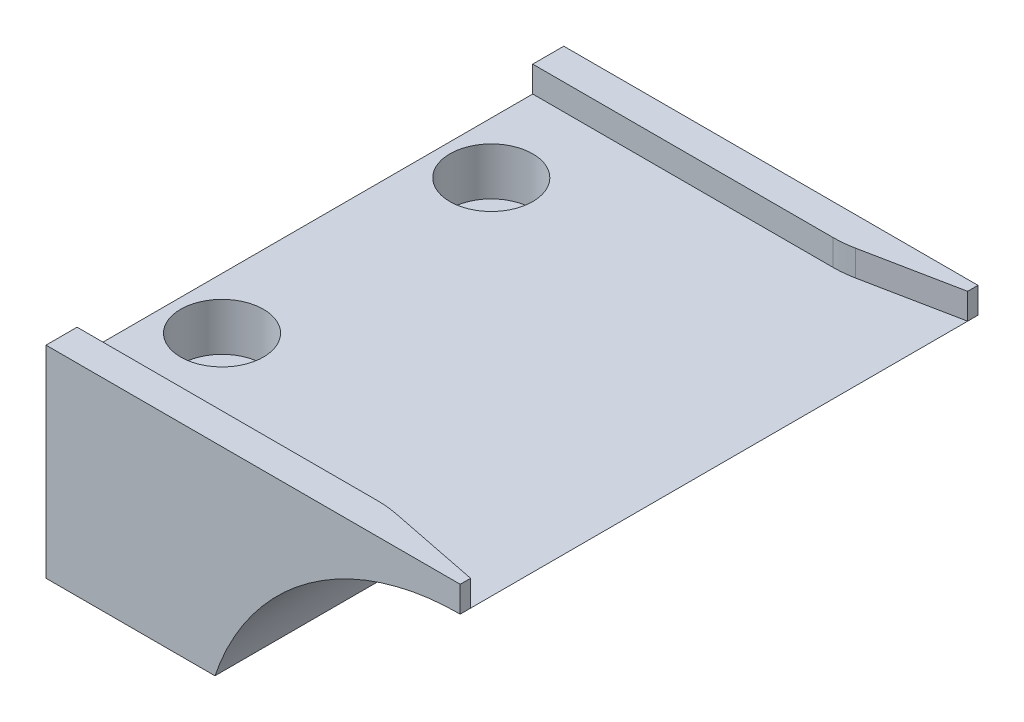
ISO-10303-21;
HEADER;
FILE_DESCRIPTION(('STEP AP214'),'2;1');
FILE_NAME('part.step','',(''),(''),'','','');
FILE_SCHEMA(('AUTOMOTIVE_DESIGN { 1 0 10303 214 1 1 1 1 }'));
ENDSEC;
DATA;
#1=APPLICATION_CONTEXT('core data for automotive mechanical design processes');
#2=APPLICATION_PROTOCOL_DEFINITION('international standard','automotive_design',2000,#1);
#3=PRODUCT_CONTEXT('',#1,'mechanical');
#4=PRODUCT('Part','Part','',(#3));
#5=PRODUCT_RELATED_PRODUCT_CATEGORY('part','',(#4));
#6=PRODUCT_DEFINITION_FORMATION('','',#4);
#7=PRODUCT_DEFINITION_CONTEXT('part definition',#1,'design');
#8=PRODUCT_DEFINITION('design','',#6,#7);
#9=PRODUCT_DEFINITION_SHAPE('','',#8);
#10=(LENGTH_UNIT() NAMED_UNIT(*) SI_UNIT(.MILLI.,.METRE.));
#11=(NAMED_UNIT(*) PLANE_ANGLE_UNIT() SI_UNIT($,.RADIAN.));
#12=(NAMED_UNIT(*) SI_UNIT($,.STERADIAN.) SOLID_ANGLE_UNIT());
#13=UNCERTAINTY_MEASURE_WITH_UNIT(LENGTH_MEASURE(1.E-05),#10,'distance_accuracy_value','');
#14=(GEOMETRIC_REPRESENTATION_CONTEXT(3) GLOBAL_UNCERTAINTY_ASSIGNED_CONTEXT((#13)) GLOBAL_UNIT_ASSIGNED_CONTEXT((#10,
#11,#12)) REPRESENTATION_CONTEXT('',''));
#15=CARTESIAN_POINT('',(0.,0.,0.));
#16=DIRECTION('',(0.,0.,1.));
#17=DIRECTION('',(1.,0.,0.));
#18=AXIS2_PLACEMENT_3D('',#15,#16,#17);
#19=CARTESIAN_POINT('',(-40.919983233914,13.236941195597,50.));
#20=DIRECTION('',(0.,-1.,0.));
#21=DIRECTION('',(1.,0.,0.));
#22=AXIS2_PLACEMENT_3D('',#19,#20,#21);
#23=PLANE('',#22);
#24=CARTESIAN_POINT('',(-75.919983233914,13.236941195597,12.));
#25=DIRECTION('',(0.,1.,0.));
#26=DIRECTION('',(0.,0.,1.));
#27=AXIS2_PLACEMENT_3D('',#24,#25,#26);
#28=CIRCLE('',#27,4.);
#29=CARTESIAN_POINT('',(-75.919983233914,13.236941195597,16.));
#30=VERTEX_POINT('',#29);
#31=EDGE_CURVE('E428',#30,#30,#28,.T.);
#32=ORIENTED_EDGE('',*,*,#31,.F.);
#33=EDGE_LOOP('',(#32));
#34=FACE_BOUND('',#33,.T.);
#35=DIRECTION('',(0.,0.,-1.));
#36=VECTOR('',#35,1.);
#37=CARTESIAN_POINT('',(-80.919983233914,13.236941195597,50.));
#38=LINE('',#37,#36);
#39=CARTESIAN_POINT('',(-80.919983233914,13.236941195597,47.));
#40=VERTEX_POINT('',#39);
#41=CARTESIAN_POINT('',(-80.919983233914,13.236941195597,3.));
#42=VERTEX_POINT('',#41);
#43=EDGE_CURVE('E177',#40,#42,#38,.T.);
#44=ORIENTED_EDGE('',*,*,#43,.F.);
#45=DIRECTION('',(-1.,0.,0.));
#46=VECTOR('',#45,1.);
#47=CARTESIAN_POINT('',(-40.919983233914,13.236941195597,47.));
#48=LINE('',#47,#46);
#49=CARTESIAN_POINT('',(-51.910178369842,13.236941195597,47.));
#50=VERTEX_POINT('',#49);
#51=EDGE_CURVE('E146',#50,#40,#48,.T.);
#52=ORIENTED_EDGE('',*,*,#51,.F.);
#53=CARTESIAN_POINT('',(-51.910178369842,13.236941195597,57.));
#54=DIRECTION('',(0.,-1.,0.));
#55=DIRECTION('',(1.,0.,0.));
#56=AXIS2_PLACEMENT_3D('',#53,#54,#55);
#57=CIRCLE('',#56,10.);
#58=CARTESIAN_POINT('',(-49.9490170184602,13.236941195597,47.1941932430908));
#59=VERTEX_POINT('',#58);
#60=EDGE_CURVE('E24',#50,#59,#57,.T.);
#61=ORIENTED_EDGE('',*,*,#60,.T.);
#62=DIRECTION('',(0.980580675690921,0.,0.196116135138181));
#63=VECTOR('',#62,1.);
#64=CARTESIAN_POINT('',(-40.7276755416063,13.236941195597,49.0384615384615));
#65=LINE('',#64,#63);
#66=CARTESIAN_POINT('',(-40.919983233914,13.236941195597,49.));
#67=VERTEX_POINT('',#66);
#68=EDGE_CURVE('E204',#59,#67,#65,.T.);
#69=ORIENTED_EDGE('',*,*,#68,.T.);
#70=DIRECTION('',(0.,0.,-1.));
#71=VECTOR('',#70,1.);
#72=CARTESIAN_POINT('',(-40.919983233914,13.236941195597,50.));
#73=LINE('',#72,#71);
#74=CARTESIAN_POINT('',(-40.919983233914,13.236941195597,1.));
#75=VERTEX_POINT('',#74);
#76=EDGE_CURVE('E185',#67,#75,#73,.T.);
#77=ORIENTED_EDGE('',*,*,#76,.T.);
#78=DIRECTION('',(0.980580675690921,0.,-0.19611613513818));
#79=VECTOR('',#78,1.);
#80=CARTESIAN_POINT('',(-50.3430601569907,13.236941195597,2.88461538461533));
#81=LINE('',#80,#79);
#82=CARTESIAN_POINT('',(-49.9490170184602,13.236941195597,2.80580675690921));
#83=VERTEX_POINT('',#82);
#84=EDGE_CURVE('E202',#75,#83,#81,.F.);
#85=ORIENTED_EDGE('',*,*,#84,.T.);
#86=CARTESIAN_POINT('',(-51.910178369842,13.236941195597,-7.));
#87=DIRECTION('',(0.,-1.,0.));
#88=DIRECTION('',(1.,0.,0.));
#89=AXIS2_PLACEMENT_3D('',#86,#87,#88);
#90=CIRCLE('',#89,10.);
#91=CARTESIAN_POINT('',(-51.910178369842,13.236941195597,3.));
#92=VERTEX_POINT('',#91);
#93=EDGE_CURVE('E11',#83,#92,#90,.T.);
#94=ORIENTED_EDGE('',*,*,#93,.T.);
#95=DIRECTION('',(-1.,0.,0.));
#96=VECTOR('',#95,1.);
#97=CARTESIAN_POINT('',(-40.919983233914,13.236941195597,3.));
#98=LINE('',#97,#96);
#99=EDGE_CURVE('E159',#92,#42,#98,.T.);
#100=ORIENTED_EDGE('',*,*,#99,.T.);
#101=EDGE_LOOP('',(#44,#52,#61,#69,#77,#85,#94,#100));
#102=FACE_BOUND('',#101,.T.);
#103=CARTESIAN_POINT('',(-75.919983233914,13.236941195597,38.));
#104=DIRECTION('',(0.,1.,0.));
#105=DIRECTION('',(0.,0.,1.));
#106=AXIS2_PLACEMENT_3D('',#103,#104,#105);
#107=CIRCLE('',#106,4.);
#108=CARTESIAN_POINT('',(-75.919983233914,13.236941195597,42.));
#109=VERTEX_POINT('',#108);
#110=EDGE_CURVE('E438',#109,#109,#107,.T.);
#111=ORIENTED_EDGE('',*,*,#110,.F.);
#112=EDGE_LOOP('',(#111));
#113=FACE_BOUND('',#112,.T.);
#114=ADVANCED_FACE('F16',(#34,#102,#113),#23,.F.);
#115=CARTESIAN_POINT('',(-80.919983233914,-3.763058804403,50.));
#116=DIRECTION('',(1.,0.,0.));
#117=DIRECTION('',(0.,0.,-1.));
#118=AXIS2_PLACEMENT_3D('',#115,#116,#117);
#119=PLANE('',#118);
#120=DIRECTION('',(0.,-1.,0.));
#121=VECTOR('',#120,1.);
#122=CARTESIAN_POINT('',(-80.919983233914,-3.763058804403,0.));
#123=LINE('',#122,#121);
#124=CARTESIAN_POINT('',(-80.919983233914,15.736941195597,0.));
#125=VERTEX_POINT('',#124);
#126=CARTESIAN_POINT('',(-80.919983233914,-3.763058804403,0.));
#127=VERTEX_POINT('',#126);
#128=EDGE_CURVE('E167',#125,#127,#123,.T.);
#129=ORIENTED_EDGE('',*,*,#128,.T.);
#130=DIRECTION('',(0.,0.,-1.));
#131=VECTOR('',#130,1.);
#132=CARTESIAN_POINT('',(-80.919983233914,-3.763058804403,50.));
#133=LINE('',#132,#131);
#134=CARTESIAN_POINT('',(-80.919983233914,-3.763058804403,50.));
#135=VERTEX_POINT('',#134);
#136=EDGE_CURVE('E191',#135,#127,#133,.T.);
#137=ORIENTED_EDGE('',*,*,#136,.F.);
#138=DIRECTION('',(0.,-1.,0.));
#139=VECTOR('',#138,1.);
#140=CARTESIAN_POINT('',(-80.919983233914,-3.763058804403,50.));
#141=LINE('',#140,#139);
#142=CARTESIAN_POINT('',(-80.919983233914,15.736941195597,50.));
#143=VERTEX_POINT('',#142);
#144=EDGE_CURVE('E171',#143,#135,#141,.T.);
#145=ORIENTED_EDGE('',*,*,#144,.F.);
#146=DIRECTION('',(0.,0.,-1.));
#147=VECTOR('',#146,1.);
#148=CARTESIAN_POINT('',(-80.919983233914,15.736941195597,50.));
#149=LINE('',#148,#147);
#150=CARTESIAN_POINT('',(-80.919983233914,15.736941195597,47.));
#151=VERTEX_POINT('',#150);
#152=EDGE_CURVE('E119',#143,#151,#149,.T.);
#153=ORIENTED_EDGE('',*,*,#152,.T.);
#154=DIRECTION('',(0.,-1.,0.));
#155=VECTOR('',#154,1.);
#156=CARTESIAN_POINT('',(-80.919983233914,13.236941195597,47.));
#157=LINE('',#156,#155);
#158=EDGE_CURVE('E137',#151,#40,#157,.T.);
#159=ORIENTED_EDGE('',*,*,#158,.T.);
#160=ORIENTED_EDGE('',*,*,#43,.T.);
#161=DIRECTION('',(0.,1.,0.));
#162=VECTOR('',#161,1.);
#163=CARTESIAN_POINT('',(-80.919983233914,13.236941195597,3.));
#164=LINE('',#163,#162);
#165=CARTESIAN_POINT('',(-80.919983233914,15.736941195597,3.));
#166=VERTEX_POINT('',#165);
#167=EDGE_CURVE('E148',#42,#166,#164,.T.);
#168=ORIENTED_EDGE('',*,*,#167,.T.);
#169=DIRECTION('',(0.,0.,-1.));
#170=VECTOR('',#169,1.);
#171=CARTESIAN_POINT('',(-80.919983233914,15.736941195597,0.));
#172=LINE('',#171,#170);
#173=EDGE_CURVE('E154',#166,#125,#172,.T.);
#174=ORIENTED_EDGE('',*,*,#173,.T.);
#175=EDGE_LOOP('',(#129,#137,#145,#153,#159,#160,#168,#174));
#176=FACE_BOUND('',#175,.T.);
#177=ADVANCED_FACE('F235',(#176),#119,.F.);
#178=CARTESIAN_POINT('',(-64.605421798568,-3.763058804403,50.));
#179=DIRECTION('',(0.,1.,0.));
#180=DIRECTION('',(-1.,0.,0.));
#181=AXIS2_PLACEMENT_3D('',#178,#179,#180);
#182=PLANE('',#181);
#183=CARTESIAN_POINT('',(-75.919983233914,-3.763058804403,12.));
#184=DIRECTION('',(0.,1.,0.));
#185=DIRECTION('',(0.,0.,1.));
#186=AXIS2_PLACEMENT_3D('',#183,#184,#185);
#187=CIRCLE('',#186,2.25);
#188=CARTESIAN_POINT('',(-75.919983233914,-3.763058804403,14.25));
#189=VERTEX_POINT('',#188);
#190=EDGE_CURVE('E435',#189,#189,#187,.T.);
#191=ORIENTED_EDGE('',*,*,#190,.T.);
#192=EDGE_LOOP('',(#191));
#193=FACE_BOUND('',#192,.T.);
#194=CARTESIAN_POINT('',(-75.919983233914,-3.763058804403,38.));
#195=DIRECTION('',(0.,1.,0.));
#196=DIRECTION('',(0.,0.,1.));
#197=AXIS2_PLACEMENT_3D('',#194,#195,#196);
#198=CIRCLE('',#197,2.25);
#199=CARTESIAN_POINT('',(-75.919983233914,-3.763058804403,40.25));
#200=VERTEX_POINT('',#199);
#201=EDGE_CURVE('E142',#200,#200,#198,.T.);
#202=ORIENTED_EDGE('',*,*,#201,.T.);
#203=EDGE_LOOP('',(#202));
#204=FACE_BOUND('',#203,.T.);
#205=DIRECTION('',(1.,0.,0.));
#206=VECTOR('',#205,1.);
#207=CARTESIAN_POINT('',(-64.605421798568,-3.763058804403,0.));
#208=LINE('',#207,#206);
#209=CARTESIAN_POINT('',(-64.605421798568,-3.763058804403,0.));
#210=VERTEX_POINT('',#209);
#211=EDGE_CURVE('E180',#127,#210,#208,.T.);
#212=ORIENTED_EDGE('',*,*,#211,.T.);
#213=DIRECTION('',(0.,0.,-1.));
#214=VECTOR('',#213,1.);
#215=CARTESIAN_POINT('',(-64.605421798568,-3.763058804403,50.));
#216=LINE('',#215,#214);
#217=CARTESIAN_POINT('',(-64.605421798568,-3.763058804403,50.));
#218=VERTEX_POINT('',#217);
#219=EDGE_CURVE('E188',#218,#210,#216,.T.);
#220=ORIENTED_EDGE('',*,*,#219,.F.);
#221=DIRECTION('',(1.,0.,0.));
#222=VECTOR('',#221,1.);
#223=CARTESIAN_POINT('',(-64.605421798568,-3.763058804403,50.));
#224=LINE('',#223,#222);
#225=EDGE_CURVE('E173',#135,#218,#224,.T.);
#226=ORIENTED_EDGE('',*,*,#225,.F.);
#227=ORIENTED_EDGE('',*,*,#136,.T.);
#228=EDGE_LOOP('',(#212,#220,#226,#227));
#229=FACE_BOUND('',#228,.T.);
#230=ADVANCED_FACE('F239',(#193,#204,#229),#182,.F.);
#231=CARTESIAN_POINT('',(-40.919983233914,-11.763058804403,50.));
#232=DIRECTION('',(0.,0.,-1.));
#233=DIRECTION('',(-1.,0.,0.));
#234=AXIS2_PLACEMENT_3D('',#231,#232,#233);
#235=CYLINDRICAL_SURFACE('',#234,25.);
#236=CARTESIAN_POINT('',(-40.919983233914,-11.763058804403,0.));
#237=DIRECTION('',(0.,0.,-1.));
#238=DIRECTION('',(1.,0.,0.));
#239=AXIS2_PLACEMENT_3D('',#236,#237,#238);
#240=CIRCLE('',#239,25.);
#241=CARTESIAN_POINT('',(-40.919983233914,13.236941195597,0.));
#242=VERTEX_POINT('',#241);
#243=EDGE_CURVE('E174',#210,#242,#240,.T.);
#244=ORIENTED_EDGE('',*,*,#243,.T.);
#245=DIRECTION('',(0.,0.,1.));
#246=VECTOR('',#245,1.);
#247=CARTESIAN_POINT('',(-40.919983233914,13.236941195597,0.));
#248=LINE('',#247,#246);
#249=EDGE_CURVE('E153',#242,#75,#248,.T.);
#250=ORIENTED_EDGE('',*,*,#249,.T.);
#251=ORIENTED_EDGE('',*,*,#76,.F.);
#252=CARTESIAN_POINT('',(-40.919983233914,13.236941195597,50.));
#253=VERTEX_POINT('',#252);
#254=EDGE_CURVE('E186',#253,#67,#73,.T.);
#255=ORIENTED_EDGE('',*,*,#254,.F.);
#256=CARTESIAN_POINT('',(-40.919983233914,-11.763058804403,50.));
#257=DIRECTION('',(0.,0.,-1.));
#258=DIRECTION('',(1.,0.,0.));
#259=AXIS2_PLACEMENT_3D('',#256,#257,#258);
#260=CIRCLE('',#259,25.);
#261=EDGE_CURVE('E135',#218,#253,#260,.T.);
#262=ORIENTED_EDGE('',*,*,#261,.F.);
#263=ORIENTED_EDGE('',*,*,#219,.T.);
#264=EDGE_LOOP('',(#244,#250,#251,#255,#262,#263));
#265=FACE_BOUND('',#264,.T.);
#266=ADVANCED_FACE('F242',(#265),#235,.F.);
#267=CARTESIAN_POINT('',(-40.919983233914,-11.763058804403,50.));
#268=DIRECTION('',(0.,0.,1.));
#269=DIRECTION('',(1.,0.,0.));
#270=AXIS2_PLACEMENT_3D('',#267,#268,#269);
#271=PLANE('',#270);
#272=ORIENTED_EDGE('',*,*,#144,.T.);
#273=ORIENTED_EDGE('',*,*,#225,.T.);
#274=ORIENTED_EDGE('',*,*,#261,.T.);
#275=DIRECTION('',(0.,1.,0.));
#276=VECTOR('',#275,1.);
#277=CARTESIAN_POINT('',(-40.919983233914,13.236941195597,50.));
#278=LINE('',#277,#276);
#279=CARTESIAN_POINT('',(-40.919983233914,15.736941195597,50.));
#280=VERTEX_POINT('',#279);
#281=EDGE_CURVE('E128',#253,#280,#278,.T.);
#282=ORIENTED_EDGE('',*,*,#281,.T.);
#283=DIRECTION('',(-1.,0.,0.));
#284=VECTOR('',#283,1.);
#285=CARTESIAN_POINT('',(-40.919983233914,15.736941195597,50.));
#286=LINE('',#285,#284);
#287=EDGE_CURVE('E112',#280,#143,#286,.T.);
#288=ORIENTED_EDGE('',*,*,#287,.T.);
#289=EDGE_LOOP('',(#272,#273,#274,#282,#288));
#290=FACE_BOUND('',#289,.T.);
#291=ADVANCED_FACE('F133',(#290),#271,.T.);
#292=CARTESIAN_POINT('',(-40.919983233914,-11.763058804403,0.));
#293=DIRECTION('',(0.,0.,1.));
#294=DIRECTION('',(1.,0.,0.));
#295=AXIS2_PLACEMENT_3D('',#292,#293,#294);
#296=PLANE('',#295);
#297=ORIENTED_EDGE('',*,*,#128,.F.);
#298=DIRECTION('',(-1.,0.,0.));
#299=VECTOR('',#298,1.);
#300=CARTESIAN_POINT('',(-40.919983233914,15.736941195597,0.));
#301=LINE('',#300,#299);
#302=CARTESIAN_POINT('',(-40.919983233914,15.736941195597,0.));
#303=VERTEX_POINT('',#302);
#304=EDGE_CURVE('E164',#303,#125,#301,.T.);
#305=ORIENTED_EDGE('',*,*,#304,.F.);
#306=DIRECTION('',(0.,-1.,0.));
#307=VECTOR('',#306,1.);
#308=CARTESIAN_POINT('',(-40.919983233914,13.236941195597,0.));
#309=LINE('',#308,#307);
#310=EDGE_CURVE('E150',#303,#242,#309,.T.);
#311=ORIENTED_EDGE('',*,*,#310,.T.);
#312=ORIENTED_EDGE('',*,*,#243,.F.);
#313=ORIENTED_EDGE('',*,*,#211,.F.);
#314=EDGE_LOOP('',(#297,#305,#311,#312,#313));
#315=FACE_BOUND('',#314,.T.);
#316=ADVANCED_FACE('F261',(#315),#296,.F.);
#317=CARTESIAN_POINT('',(-40.919983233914,15.736941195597,0.));
#318=DIRECTION('',(0.,1.,0.));
#319=DIRECTION('',(0.,0.,1.));
#320=AXIS2_PLACEMENT_3D('',#317,#318,#319);
#321=PLANE('',#320);
#322=DIRECTION('',(-1.,0.,0.));
#323=VECTOR('',#322,1.);
#324=CARTESIAN_POINT('',(-40.919983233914,15.736941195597,3.));
#325=LINE('',#324,#323);
#326=CARTESIAN_POINT('',(-51.910178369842,15.736941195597,3.));
#327=VERTEX_POINT('',#326);
#328=EDGE_CURVE('E168',#327,#166,#325,.T.);
#329=ORIENTED_EDGE('',*,*,#328,.F.);
#330=CARTESIAN_POINT('',(-51.910178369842,15.736941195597,-7.));
#331=DIRECTION('',(0.,1.,0.));
#332=DIRECTION('',(0.,0.,1.));
#333=AXIS2_PLACEMENT_3D('',#330,#331,#332);
#334=CIRCLE('',#333,10.);
#335=CARTESIAN_POINT('',(-49.9490170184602,15.736941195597,2.80580675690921));
#336=VERTEX_POINT('',#335);
#337=EDGE_CURVE('E39',#327,#336,#334,.T.);
#338=ORIENTED_EDGE('',*,*,#337,.T.);
#339=DIRECTION('',(-0.980580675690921,0.,0.19611613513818));
#340=VECTOR('',#339,1.);
#341=CARTESIAN_POINT('',(-40.7276755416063,15.736941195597,0.961538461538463));
#342=LINE('',#341,#340);
#343=CARTESIAN_POINT('',(-40.919983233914,15.736941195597,1.));
#344=VERTEX_POINT('',#343);
#345=EDGE_CURVE('E194',#336,#344,#342,.F.);
#346=ORIENTED_EDGE('',*,*,#345,.T.);
#347=DIRECTION('',(0.,0.,-1.));
#348=VECTOR('',#347,1.);
#349=CARTESIAN_POINT('',(-40.919983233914,15.736941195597,0.));
#350=LINE('',#349,#348);
#351=EDGE_CURVE('E157',#344,#303,#350,.T.);
#352=ORIENTED_EDGE('',*,*,#351,.T.);
#353=ORIENTED_EDGE('',*,*,#304,.T.);
#354=ORIENTED_EDGE('',*,*,#173,.F.);
#355=EDGE_LOOP('',(#329,#338,#346,#352,#353,#354));
#356=FACE_BOUND('',#355,.T.);
#357=ADVANCED_FACE('F258',(#356),#321,.T.);
#358=CARTESIAN_POINT('',(-40.919983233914,13.236941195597,3.));
#359=DIRECTION('',(0.,0.,1.));
#360=DIRECTION('',(1.,0.,0.));
#361=AXIS2_PLACEMENT_3D('',#358,#359,#360);
#362=PLANE('',#361);
#363=ORIENTED_EDGE('',*,*,#99,.F.);
#364=DIRECTION('',(0.,-1.,0.));
#365=VECTOR('',#364,1.);
#366=CARTESIAN_POINT('',(-51.910178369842,13.236941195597,3.));
#367=LINE('',#366,#365);
#368=EDGE_CURVE('E213',#92,#327,#367,.F.);
#369=ORIENTED_EDGE('',*,*,#368,.T.);
#370=ORIENTED_EDGE('',*,*,#328,.T.);
#371=ORIENTED_EDGE('',*,*,#167,.F.);
#372=EDGE_LOOP('',(#363,#369,#370,#371));
#373=FACE_BOUND('',#372,.T.);
#374=ADVANCED_FACE('F256',(#373),#362,.T.);
#375=CARTESIAN_POINT('',(-40.919983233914,0.,0.));
#376=DIRECTION('',(1.,0.,0.));
#377=DIRECTION('',(0.,0.,-1.));
#378=AXIS2_PLACEMENT_3D('',#375,#376,#377);
#379=PLANE('',#378);
#380=ORIENTED_EDGE('',*,*,#351,.F.);
#381=DIRECTION('',(0.,-1.,0.));
#382=VECTOR('',#381,1.);
#383=CARTESIAN_POINT('',(-40.919983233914,0.,1.));
#384=LINE('',#383,#382);
#385=EDGE_CURVE('E196',#344,#75,#384,.T.);
#386=ORIENTED_EDGE('',*,*,#385,.T.);
#387=ORIENTED_EDGE('',*,*,#249,.F.);
#388=ORIENTED_EDGE('',*,*,#310,.F.);
#389=EDGE_LOOP('',(#380,#386,#387,#388));
#390=FACE_BOUND('',#389,.T.);
#391=ADVANCED_FACE('F248',(#390),#379,.T.);
#392=CARTESIAN_POINT('',(-40.919983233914,13.236941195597,47.));
#393=DIRECTION('',(0.,0.,-1.));
#394=DIRECTION('',(-1.,0.,0.));
#395=AXIS2_PLACEMENT_3D('',#392,#393,#394);
#396=PLANE('',#395);
#397=DIRECTION('',(-1.,0.,0.));
#398=VECTOR('',#397,1.);
#399=CARTESIAN_POINT('',(-40.919983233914,15.736941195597,47.));
#400=LINE('',#399,#398);
#401=CARTESIAN_POINT('',(-51.910178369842,15.736941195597,47.));
#402=VERTEX_POINT('',#401);
#403=EDGE_CURVE('E123',#402,#151,#400,.T.);
#404=ORIENTED_EDGE('',*,*,#403,.F.);
#405=DIRECTION('',(0.,-1.,0.));
#406=VECTOR('',#405,1.);
#407=CARTESIAN_POINT('',(-51.910178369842,13.236941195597,47.));
#408=LINE('',#407,#406);
#409=EDGE_CURVE('E206',#402,#50,#408,.T.);
#410=ORIENTED_EDGE('',*,*,#409,.T.);
#411=ORIENTED_EDGE('',*,*,#51,.T.);
#412=ORIENTED_EDGE('',*,*,#158,.F.);
#413=EDGE_LOOP('',(#404,#410,#411,#412));
#414=FACE_BOUND('',#413,.T.);
#415=ADVANCED_FACE('F233',(#414),#396,.T.);
#416=CARTESIAN_POINT('',(-40.919983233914,15.736941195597,50.));
#417=DIRECTION('',(0.,1.,0.));
#418=DIRECTION('',(0.,0.,1.));
#419=AXIS2_PLACEMENT_3D('',#416,#417,#418);
#420=PLANE('',#419);
#421=DIRECTION('',(-0.980580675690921,0.,-0.196116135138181));
#422=VECTOR('',#421,1.);
#423=CARTESIAN_POINT('',(-40.7276755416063,15.736941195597,49.0384615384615));
#424=LINE('',#423,#422);
#425=CARTESIAN_POINT('',(-40.919983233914,15.736941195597,49.));
#426=VERTEX_POINT('',#425);
#427=CARTESIAN_POINT('',(-49.9490170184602,15.736941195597,47.1941932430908));
#428=VERTEX_POINT('',#427);
#429=EDGE_CURVE('E200',#426,#428,#424,.T.);
#430=ORIENTED_EDGE('',*,*,#429,.T.);
#431=CARTESIAN_POINT('',(-51.910178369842,15.736941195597,57.));
#432=DIRECTION('',(0.,1.,0.));
#433=DIRECTION('',(0.,0.,1.));
#434=AXIS2_PLACEMENT_3D('',#431,#432,#433);
#435=CIRCLE('',#434,10.);
#436=EDGE_CURVE('E211',#428,#402,#435,.T.);
#437=ORIENTED_EDGE('',*,*,#436,.T.);
#438=ORIENTED_EDGE('',*,*,#403,.T.);
#439=ORIENTED_EDGE('',*,*,#152,.F.);
#440=ORIENTED_EDGE('',*,*,#287,.F.);
#441=DIRECTION('',(0.,0.,-1.));
#442=VECTOR('',#441,1.);
#443=CARTESIAN_POINT('',(-40.919983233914,15.736941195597,50.));
#444=LINE('',#443,#442);
#445=EDGE_CURVE('E116',#280,#426,#444,.T.);
#446=ORIENTED_EDGE('',*,*,#445,.T.);
#447=EDGE_LOOP('',(#430,#437,#438,#439,#440,#446));
#448=FACE_BOUND('',#447,.T.);
#449=ADVANCED_FACE('F115',(#448),#420,.T.);
#450=CARTESIAN_POINT('',(-40.919983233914,0.,0.));
#451=DIRECTION('',(-1.,0.,0.));
#452=DIRECTION('',(0.,0.,1.));
#453=AXIS2_PLACEMENT_3D('',#450,#451,#452);
#454=PLANE('',#453);
#455=ORIENTED_EDGE('',*,*,#254,.T.);
#456=DIRECTION('',(0.,1.,0.));
#457=VECTOR('',#456,1.);
#458=CARTESIAN_POINT('',(-40.919983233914,15.736941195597,49.));
#459=LINE('',#458,#457);
#460=EDGE_CURVE('E131',#67,#426,#459,.T.);
#461=ORIENTED_EDGE('',*,*,#460,.T.);
#462=ORIENTED_EDGE('',*,*,#445,.F.);
#463=ORIENTED_EDGE('',*,*,#281,.F.);
#464=EDGE_LOOP('',(#455,#461,#462,#463));
#465=FACE_BOUND('',#464,.T.);
#466=ADVANCED_FACE('F127',(#465),#454,.F.);
#467=CARTESIAN_POINT('',(-50.9199832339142,13.236941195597,3.));
#468=DIRECTION('',(-0.19611613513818,0.,-0.980580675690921));
#469=DIRECTION('',(0.,1.,0.));
#470=AXIS2_PLACEMENT_3D('',#467,#468,#469);
#471=PLANE('',#470);
#472=ORIENTED_EDGE('',*,*,#345,.F.);
#473=DIRECTION('',(0.,1.,0.));
#474=VECTOR('',#473,1.);
#475=CARTESIAN_POINT('',(-49.9490170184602,13.236941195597,2.80580675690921));
#476=LINE('',#475,#474);
#477=EDGE_CURVE('E31',#336,#83,#476,.F.);
#478=ORIENTED_EDGE('',*,*,#477,.T.);
#479=ORIENTED_EDGE('',*,*,#84,.F.);
#480=ORIENTED_EDGE('',*,*,#385,.F.);
#481=EDGE_LOOP('',(#472,#478,#479,#480));
#482=FACE_BOUND('',#481,.T.);
#483=ADVANCED_FACE('F250',(#482),#471,.F.);
#484=CARTESIAN_POINT('',(-50.9199832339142,13.236941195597,47.));
#485=DIRECTION('',(0.196116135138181,0.,-0.980580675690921));
#486=DIRECTION('',(0.,1.,0.));
#487=AXIS2_PLACEMENT_3D('',#484,#485,#486);
#488=PLANE('',#487);
#489=ORIENTED_EDGE('',*,*,#68,.F.);
#490=DIRECTION('',(0.,-1.,0.));
#491=VECTOR('',#490,1.);
#492=CARTESIAN_POINT('',(-49.9490170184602,13.236941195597,47.1941932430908));
#493=LINE('',#492,#491);
#494=EDGE_CURVE('E209',#59,#428,#493,.F.);
#495=ORIENTED_EDGE('',*,*,#494,.T.);
#496=ORIENTED_EDGE('',*,*,#429,.F.);
#497=ORIENTED_EDGE('',*,*,#460,.F.);
#498=EDGE_LOOP('',(#489,#495,#496,#497));
#499=FACE_BOUND('',#498,.T.);
#500=ADVANCED_FACE('F227',(#499),#488,.T.);
#501=CARTESIAN_POINT('',(-51.910178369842,13.236941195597,57.));
#502=DIRECTION('',(0.,-1.,0.));
#503=DIRECTION('',(0.,0.,-1.));
#504=AXIS2_PLACEMENT_3D('',#501,#502,#503);
#505=CYLINDRICAL_SURFACE('',#504,10.);
#506=ORIENTED_EDGE('',*,*,#436,.F.);
#507=ORIENTED_EDGE('',*,*,#494,.F.);
#508=ORIENTED_EDGE('',*,*,#60,.F.);
#509=ORIENTED_EDGE('',*,*,#409,.F.);
#510=EDGE_LOOP('',(#506,#507,#508,#509));
#511=FACE_BOUND('',#510,.T.);
#512=ADVANCED_FACE('F229',(#511),#505,.T.);
#513=CARTESIAN_POINT('',(-51.910178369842,13.236941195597,-7.));
#514=DIRECTION('',(0.,-1.,0.));
#515=DIRECTION('',(0.,0.,-1.));
#516=AXIS2_PLACEMENT_3D('',#513,#514,#515);
#517=CYLINDRICAL_SURFACE('',#516,10.);
#518=ORIENTED_EDGE('',*,*,#93,.F.);
#519=ORIENTED_EDGE('',*,*,#477,.F.);
#520=ORIENTED_EDGE('',*,*,#337,.F.);
#521=ORIENTED_EDGE('',*,*,#368,.F.);
#522=EDGE_LOOP('',(#518,#519,#520,#521));
#523=FACE_BOUND('',#522,.T.);
#524=ADVANCED_FACE('F18',(#523),#517,.T.);
#525=CARTESIAN_POINT('',(-75.919983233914,13.236941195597,38.));
#526=DIRECTION('',(0.,1.,0.));
#527=DIRECTION('',(0.,0.,1.));
#528=AXIS2_PLACEMENT_3D('',#525,#526,#527);
#529=CYLINDRICAL_SURFACE('',#528,2.25);
#530=ORIENTED_EDGE('',*,*,#201,.F.);
#531=EDGE_LOOP('',(#530));
#532=FACE_BOUND('',#531,.T.);
#533=CARTESIAN_POINT('',(-75.919983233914,8.636941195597,38.));
#534=DIRECTION('',(0.,1.,0.));
#535=DIRECTION('',(0.,0.,1.));
#536=AXIS2_PLACEMENT_3D('',#533,#534,#535);
#537=CIRCLE('',#536,2.25);
#538=CARTESIAN_POINT('',(-75.919983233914,8.636941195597,40.25));
#539=VERTEX_POINT('',#538);
#540=EDGE_CURVE('E443',#539,#539,#537,.T.);
#541=ORIENTED_EDGE('',*,*,#540,.T.);
#542=EDGE_LOOP('',(#541));
#543=FACE_BOUND('',#542,.T.);
#544=ADVANCED_FACE('F295',(#532,#543),#529,.F.);
#545=CARTESIAN_POINT('',(-73.669983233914,8.636941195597,38.));
#546=DIRECTION('',(0.,-1.,0.));
#547=DIRECTION('',(0.,0.,-1.));
#548=AXIS2_PLACEMENT_3D('',#545,#546,#547);
#549=PLANE('',#548);
#550=ORIENTED_EDGE('',*,*,#540,.F.);
#551=EDGE_LOOP('',(#550));
#552=FACE_BOUND('',#551,.T.);
#553=CARTESIAN_POINT('',(-75.919983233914,8.636941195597,38.));
#554=DIRECTION('',(0.,1.,0.));
#555=DIRECTION('',(0.,0.,1.));
#556=AXIS2_PLACEMENT_3D('',#553,#554,#555);
#557=CIRCLE('',#556,4.);
#558=CARTESIAN_POINT('',(-75.919983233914,8.636941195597,42.));
#559=VERTEX_POINT('',#558);
#560=EDGE_CURVE('E441',#559,#559,#557,.T.);
#561=ORIENTED_EDGE('',*,*,#560,.T.);
#562=EDGE_LOOP('',(#561));
#563=FACE_BOUND('',#562,.T.);
#564=ADVANCED_FACE('F300',(#552,#563),#549,.F.);
#565=CARTESIAN_POINT('',(-75.919983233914,13.236941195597,38.));
#566=DIRECTION('',(0.,1.,0.));
#567=DIRECTION('',(0.,0.,1.));
#568=AXIS2_PLACEMENT_3D('',#565,#566,#567);
#569=CYLINDRICAL_SURFACE('',#568,4.);
#570=ORIENTED_EDGE('',*,*,#560,.F.);
#571=EDGE_LOOP('',(#570));
#572=FACE_BOUND('',#571,.T.);
#573=ORIENTED_EDGE('',*,*,#110,.T.);
#574=EDGE_LOOP('',(#573));
#575=FACE_BOUND('',#574,.T.);
#576=ADVANCED_FACE('F307',(#572,#575),#569,.F.);
#577=CARTESIAN_POINT('',(-75.919983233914,13.236941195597,12.));
#578=DIRECTION('',(0.,1.,0.));
#579=DIRECTION('',(0.,0.,1.));
#580=AXIS2_PLACEMENT_3D('',#577,#578,#579);
#581=CYLINDRICAL_SURFACE('',#580,2.25);
#582=ORIENTED_EDGE('',*,*,#190,.F.);
#583=EDGE_LOOP('',(#582));
#584=FACE_BOUND('',#583,.T.);
#585=CARTESIAN_POINT('',(-75.919983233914,8.636941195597,12.));
#586=DIRECTION('',(0.,1.,0.));
#587=DIRECTION('',(0.,0.,1.));
#588=AXIS2_PLACEMENT_3D('',#585,#586,#587);
#589=CIRCLE('',#588,2.25);
#590=CARTESIAN_POINT('',(-75.919983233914,8.636941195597,14.25));
#591=VERTEX_POINT('',#590);
#592=EDGE_CURVE('E430',#591,#591,#589,.T.);
#593=ORIENTED_EDGE('',*,*,#592,.T.);
#594=EDGE_LOOP('',(#593));
#595=FACE_BOUND('',#594,.T.);
#596=ADVANCED_FACE('F387',(#584,#595),#581,.F.);
#597=CARTESIAN_POINT('',(-73.669983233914,8.636941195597,12.));
#598=DIRECTION('',(0.,-1.,0.));
#599=DIRECTION('',(0.,0.,-1.));
#600=AXIS2_PLACEMENT_3D('',#597,#598,#599);
#601=PLANE('',#600);
#602=ORIENTED_EDGE('',*,*,#592,.F.);
#603=EDGE_LOOP('',(#602));
#604=FACE_BOUND('',#603,.T.);
#605=CARTESIAN_POINT('',(-75.919983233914,8.636941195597,12.));
#606=DIRECTION('',(0.,1.,0.));
#607=DIRECTION('',(0.,0.,1.));
#608=AXIS2_PLACEMENT_3D('',#605,#606,#607);
#609=CIRCLE('',#608,4.);
#610=CARTESIAN_POINT('',(-75.919983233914,8.636941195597,16.));
#611=VERTEX_POINT('',#610);
#612=EDGE_CURVE('E426',#611,#611,#609,.T.);
#613=ORIENTED_EDGE('',*,*,#612,.T.);
#614=EDGE_LOOP('',(#613));
#615=FACE_BOUND('',#614,.T.);
#616=ADVANCED_FACE('F396',(#604,#615),#601,.F.);
#617=CARTESIAN_POINT('',(-75.919983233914,13.236941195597,12.));
#618=DIRECTION('',(0.,1.,0.));
#619=DIRECTION('',(0.,0.,1.));
#620=AXIS2_PLACEMENT_3D('',#617,#618,#619);
#621=CYLINDRICAL_SURFACE('',#620,4.);
#622=ORIENTED_EDGE('',*,*,#612,.F.);
#623=EDGE_LOOP('',(#622));
#624=FACE_BOUND('',#623,.T.);
#625=ORIENTED_EDGE('',*,*,#31,.T.);
#626=EDGE_LOOP('',(#625));
#627=FACE_BOUND('',#626,.T.);
#628=ADVANCED_FACE('F406',(#624,#627),#621,.F.);
#629=CLOSED_SHELL('',(#114,#177,#230,#266,#291,#316,#357,#374,#391,#415,#449,#466,#483,#500,
#512,#524,#544,#564,#576,#596,#616,#628));
#630=MANIFOLD_SOLID_BREP('B1',#629);
#631=ADVANCED_BREP_SHAPE_REPRESENTATION('',(#18,#630),#14);
#632=SHAPE_DEFINITION_REPRESENTATION(#9,#631);
ENDSEC;
END-ISO-10303-21;
